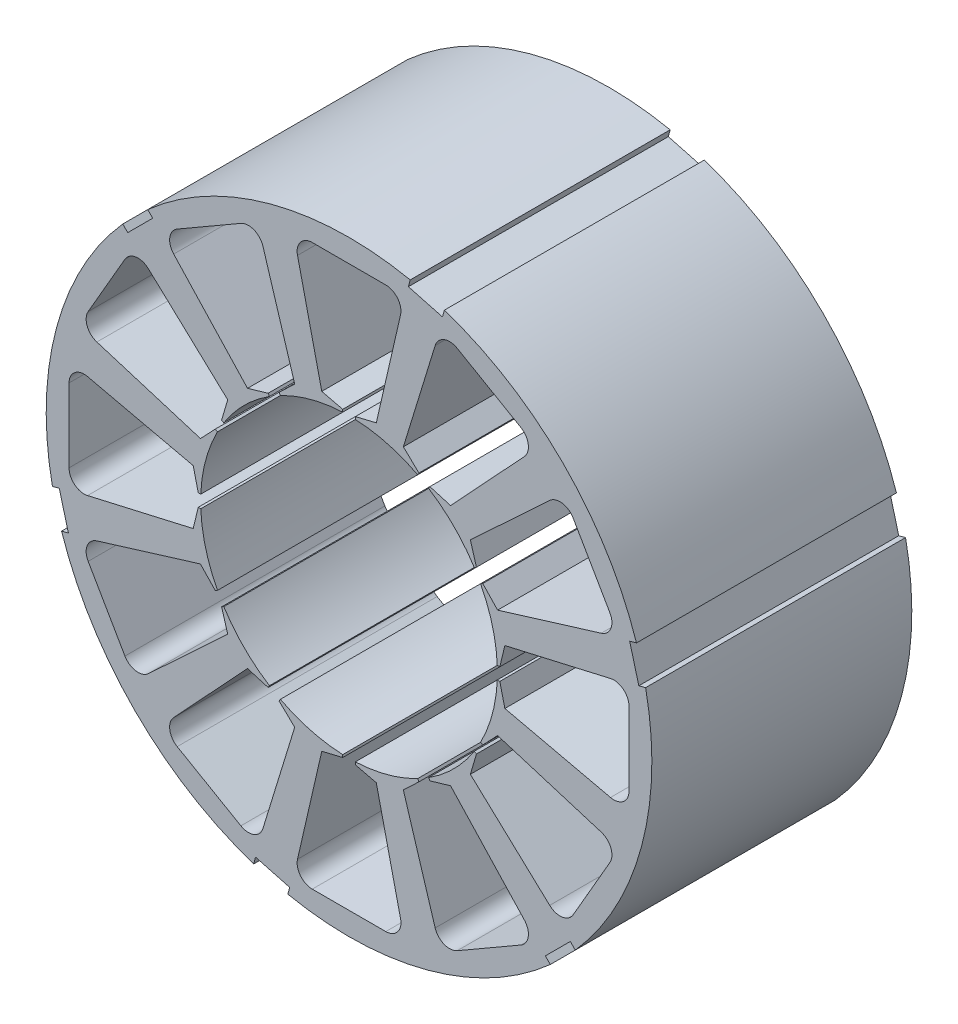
from build123d import *

# Parameters (mm, degrees)
SKICA1_R                 = 60
P_IDAT_VYSUNUT_M1_DEPTH  = 51.5
SKICA2_R                 = 29.4
ODEBRAT_VYSUNUT_M1_DEPTH = 51.5
ODEBRAT_VYSUNUT_M2_DEPTH = 51.5
ODEBRAT_VYSUNUT_M3_DEPTH = 51.5


with BuildPart() as part:
    # Skica1 → P_idat vysunut_m1 (new body)
    with BuildSketch(Plane.XY):
        Circle(SKICA1_R)
    extrude(amount=P_IDAT_VYSUNUT_M1_DEPTH)

    # Skica2 → Odebrat vysunut_m1 (cut)
    with BuildSketch(Plane.XY.offset(51.5)):
        Circle(SKICA2_R)
    extrude(amount=-ODEBRAT_VYSUNUT_M1_DEPTH, mode=Mode.SUBTRACT)

    # Skica3 → Odebrat vysunut_m2 (cut)
    with BuildSketch(Plane.XY.offset(51.5)):
        with BuildLine():
            Line((1.25, 29.373414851), (-1.25, 29.373414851))
            Line((-1.25, 29.373414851), (-1.25, 29.873414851))
            Line((-1.25, 29.873414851), (-5.4, 30.873414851))
            Line((-5.4, 30.873414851), (-10.206739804, 51.801874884))
            ThreePointArc((-10.206739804, 51.801874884), (-9.629632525, 54.342288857), (-7.282866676, 55.473414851))
            Line((-7.282866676, 55.473414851), (7.282866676, 55.473414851))
            ThreePointArc((7.282866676, 55.473414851), (9.629632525, 54.342288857), (10.206739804, 51.801874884))
            Line((10.206739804, 51.801874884), (5.4, 30.873414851))
            Line((5.4, 30.873414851), (1.25, 29.873414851))
            Line((1.25, 29.873414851), (1.25, 29.373414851))
        make_face()
        with BuildLine():
            Line((20.113244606, 24.037161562), (34.740233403, 39.758369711))
            ThreePointArc((34.740233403, 39.758369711), (35.510650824, 42.246986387), (34.043854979, 44.399953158))
            Line((34.043854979, 44.399953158), (21.429559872, 51.682819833))
            ThreePointArc((21.429559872, 51.682819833), (18.831638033, 51.876618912), (17.061641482, 49.965109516))
            Line((17.061641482, 49.965109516), (10.760170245, 29.437161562))
            Line((10.760170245, 29.437161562), (13.854175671, 26.496136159))
            Line((13.854175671, 26.496136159), (13.604175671, 26.063123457))
            Line((13.604175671, 26.063123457), (15.76923918, 24.813123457))
            Line((15.76923918, 24.813123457), (16.01923918, 25.246136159))
            Line((16.01923918, 25.246136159), (20.113244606, 24.037161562))
        make_face()
        with BuildLine():
            Line((29.437161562, 10.760170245), (49.965109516, 17.061641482))
            ThreePointArc((49.965109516, 17.061641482), (51.876618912, 18.831638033), (51.682819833, 21.429559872))
            Line((51.682819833, 21.429559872), (44.399953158, 34.043854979))
            ThreePointArc((44.399953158, 34.043854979), (42.246986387, 35.510650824), (39.758369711, 34.740233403))
            Line((39.758369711, 34.740233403), (24.037161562, 20.113244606))
            Line((24.037161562, 20.113244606), (25.246136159, 16.01923918))
            Line((25.246136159, 16.01923918), (24.813123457, 15.76923918))
            Line((24.813123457, 15.76923918), (26.063123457, 13.604175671))
            Line((26.063123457, 13.604175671), (26.496136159, 13.854175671))
            Line((26.496136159, 13.854175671), (29.437161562, 10.760170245))
        make_face()
        with BuildLine():
            Line((30.873414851, -5.4), (51.801874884, -10.206739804))
            ThreePointArc((51.801874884, -10.206739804), (54.342288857, -9.629632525), (55.473414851, -7.282866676))
            Line((55.473414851, -7.282866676), (55.473414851, 7.282866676))
            ThreePointArc((55.473414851, 7.282866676), (54.342288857, 9.629632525), (51.801874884, 10.206739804))
            Line((51.801874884, 10.206739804), (30.873414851, 5.4))
            Line((30.873414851, 5.4), (29.873414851, 1.25))
            Line((29.873414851, 1.25), (29.373414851, 1.25))
            Line((29.373414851, 1.25), (29.373414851, -1.25))
            Line((29.373414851, -1.25), (29.873414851, -1.25))
            Line((29.873414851, -1.25), (30.873414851, -5.4))
        make_face()
        with BuildLine():
            Line((24.037161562, -20.113244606), (39.758369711, -34.740233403))
            ThreePointArc((39.758369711, -34.740233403), (42.246986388, -35.510650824), (44.399953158, -34.043854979))
            Line((44.399953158, -34.043854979), (51.682819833, -21.429559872))
            ThreePointArc((51.682819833, -21.429559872), (51.876618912, -18.831638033), (49.965109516, -17.061641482))
            Line((49.965109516, -17.061641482), (29.437161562, -10.760170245))
            Line((29.437161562, -10.760170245), (26.496136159, -13.854175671))
            Line((26.496136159, -13.854175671), (26.063123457, -13.604175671))
            Line((26.063123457, -13.604175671), (24.813123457, -15.76923918))
            Line((24.813123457, -15.76923918), (25.246136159, -16.01923918))
            Line((25.246136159, -16.01923918), (24.037161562, -20.113244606))
        make_face()
        with BuildLine():
            Line((10.760170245, -29.437161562), (17.061641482, -49.965109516))
            ThreePointArc((17.061641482, -49.965109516), (18.831638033, -51.876618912), (21.429559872, -51.682819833))
            Line((21.429559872, -51.682819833), (34.043854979, -44.399953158))
            ThreePointArc((34.043854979, -44.399953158), (35.510650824, -42.246986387), (34.740233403, -39.758369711))
            Line((34.740233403, -39.758369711), (20.113244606, -24.037161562))
            Line((20.113244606, -24.037161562), (16.01923918, -25.246136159))
            Line((16.01923918, -25.246136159), (15.76923918, -24.813123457))
            Line((15.76923918, -24.813123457), (13.604175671, -26.063123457))
            Line((13.604175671, -26.063123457), (13.854175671, -26.496136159))
            Line((13.854175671, -26.496136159), (10.760170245, -29.437161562))
        make_face()
        with BuildLine():
            Line((-5.4, -30.873414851), (-10.206739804, -51.801874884))
            ThreePointArc((-10.206739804, -51.801874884), (-9.629632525, -54.342288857), (-7.282866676, -55.473414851))
            Line((-7.282866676, -55.473414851), (7.282866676, -55.473414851))
            ThreePointArc((7.282866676, -55.473414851), (9.629632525, -54.342288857), (10.206739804, -51.801874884))
            Line((10.206739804, -51.801874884), (5.4, -30.873414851))
            Line((5.4, -30.873414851), (1.25, -29.873414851))
            Line((1.25, -29.873414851), (1.25, -29.373414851))
            Line((1.25, -29.373414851), (-1.25, -29.373414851))
            Line((-1.25, -29.373414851), (-1.25, -29.873414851))
            Line((-1.25, -29.873414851), (-5.4, -30.873414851))
        make_face()
        with BuildLine():
            Line((-20.113244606, -24.037161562), (-34.740233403, -39.758369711))
            ThreePointArc((-34.740233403, -39.758369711), (-35.510650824, -42.246986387), (-34.043854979, -44.399953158))
            Line((-34.043854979, -44.399953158), (-21.429559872, -51.682819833))
            ThreePointArc((-21.429559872, -51.682819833), (-18.831638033, -51.876618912), (-17.061641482, -49.965109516))
            Line((-17.061641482, -49.965109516), (-10.760170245, -29.437161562))
            Line((-10.760170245, -29.437161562), (-13.854175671, -26.496136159))
            Line((-13.854175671, -26.496136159), (-13.604175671, -26.063123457))
            Line((-13.604175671, -26.063123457), (-15.76923918, -24.813123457))
            Line((-15.76923918, -24.813123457), (-16.01923918, -25.246136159))
            Line((-16.01923918, -25.246136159), (-20.113244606, -24.037161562))
        make_face()
        with BuildLine():
            Line((-29.437161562, -10.760170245), (-49.965109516, -17.061641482))
            ThreePointArc((-49.965109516, -17.061641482), (-51.876618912, -18.831638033), (-51.682819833, -21.429559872))
            Line((-51.682819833, -21.429559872), (-44.399953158, -34.043854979))
            ThreePointArc((-44.399953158, -34.043854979), (-42.246986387, -35.510650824), (-39.758369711, -34.740233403))
            Line((-39.758369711, -34.740233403), (-24.037161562, -20.113244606))
            Line((-24.037161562, -20.113244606), (-25.246136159, -16.01923918))
            Line((-25.246136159, -16.01923918), (-24.813123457, -15.76923918))
            Line((-24.813123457, -15.76923918), (-26.063123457, -13.604175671))
            Line((-26.063123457, -13.604175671), (-26.496136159, -13.854175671))
            Line((-26.496136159, -13.854175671), (-29.437161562, -10.760170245))
        make_face()
        with BuildLine():
            Line((-30.873414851, 5.4), (-51.801874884, 10.206739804))
            ThreePointArc((-51.801874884, 10.206739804), (-54.342288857, 9.629632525), (-55.473414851, 7.282866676))
            Line((-55.473414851, 7.282866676), (-55.473414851, -7.282866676))
            ThreePointArc((-55.473414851, -7.282866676), (-54.342288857, -9.629632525), (-51.801874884, -10.206739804))
            Line((-51.801874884, -10.206739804), (-30.873414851, -5.4))
            Line((-30.873414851, -5.4), (-29.873414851, -1.25))
            Line((-29.873414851, -1.25), (-29.373414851, -1.25))
            Line((-29.373414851, -1.25), (-29.373414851, 1.25))
            Line((-29.373414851, 1.25), (-29.873414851, 1.25))
            Line((-29.873414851, 1.25), (-30.873414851, 5.4))
        make_face()
        with BuildLine():
            Line((-24.037161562, 20.113244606), (-39.758369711, 34.740233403))
            ThreePointArc((-39.758369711, 34.740233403), (-42.246986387, 35.510650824), (-44.399953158, 34.043854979))
            Line((-44.399953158, 34.043854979), (-51.682819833, 21.429559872))
            ThreePointArc((-51.682819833, 21.429559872), (-51.876618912, 18.831638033), (-49.965109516, 17.061641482))
            Line((-49.965109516, 17.061641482), (-29.437161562, 10.760170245))
            Line((-29.437161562, 10.760170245), (-26.496136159, 13.854175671))
            Line((-26.496136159, 13.854175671), (-26.063123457, 13.604175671))
            Line((-26.063123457, 13.604175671), (-24.813123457, 15.76923918))
            Line((-24.813123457, 15.76923918), (-25.246136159, 16.01923918))
            Line((-25.246136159, 16.01923918), (-24.037161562, 20.113244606))
        make_face()
        with BuildLine():
            Line((-10.760170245, 29.437161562), (-17.061641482, 49.965109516))
            ThreePointArc((-17.061641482, 49.965109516), (-18.831638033, 51.876618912), (-21.429559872, 51.682819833))
            Line((-21.429559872, 51.682819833), (-34.043854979, 44.399953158))
            ThreePointArc((-34.043854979, 44.399953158), (-35.510650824, 42.246986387), (-34.740233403, 39.758369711))
            Line((-34.740233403, 39.758369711), (-20.113244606, 24.037161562))
            Line((-20.113244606, 24.037161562), (-16.01923918, 25.246136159))
            Line((-16.01923918, 25.246136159), (-15.76923918, 24.813123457))
            Line((-15.76923918, 24.813123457), (-13.604175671, 26.063123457))
            Line((-13.604175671, 26.063123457), (-13.854175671, 26.496136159))
            Line((-13.854175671, 26.496136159), (-10.760170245, 29.437161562))
        make_face()
    extrude(amount=-ODEBRAT_VYSUNUT_M2_DEPTH, mode=Mode.SUBTRACT)

    # Skica5 → Odebrat vysunut_m3 (cut)
    with BuildSketch(Plane.XY.offset(51.5)):
        Polygon((12.148402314, 58.861416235), (18.909883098, 57.049682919), (18.521654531, 55.60079418), (11.760173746, 57.412527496), align=None)
        Polygon((57.049682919, 18.909883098), (55.60079418, 18.521654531), (57.412527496, 11.760173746), (58.861416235, 12.148402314), align=None)
        Polygon((44.901280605, -39.951533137), (43.840620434, -38.890872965), (38.890872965, -43.840620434), (39.951533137, -44.901280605), align=None)
        Polygon((-12.148402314, -58.861416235), (-11.760173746, -57.412527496), (-18.52165453, -55.60079418), (-18.909883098, -57.049682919), align=None)
        Polygon((-57.049682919, -18.909883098), (-55.60079418, -18.521654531), (-57.412527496, -11.760173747), (-58.861416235, -12.148402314), align=None)
        Polygon((-44.901280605, 39.951533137), (-43.840620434, 38.890872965), (-38.890872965, 43.840620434), (-39.951533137, 44.901280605), align=None)
    extrude(amount=-ODEBRAT_VYSUNUT_M3_DEPTH, mode=Mode.SUBTRACT)


solid = part.part
